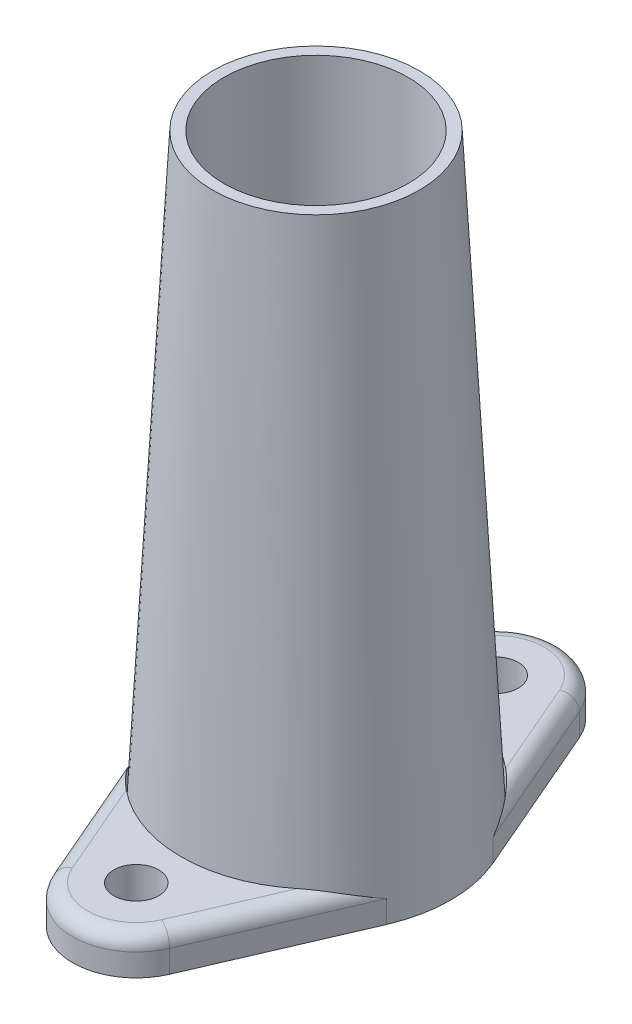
ISO-10303-21;
HEADER;
FILE_DESCRIPTION(('STEP AP214'),'2;1');
FILE_NAME('part.step','',(''),(''),'','','');
FILE_SCHEMA(('AUTOMOTIVE_DESIGN { 1 0 10303 214 1 1 1 1 }'));
ENDSEC;
DATA;
#1=APPLICATION_CONTEXT('core data for automotive mechanical design processes');
#2=APPLICATION_PROTOCOL_DEFINITION('international standard','automotive_design',2000,#1);
#3=PRODUCT_CONTEXT('',#1,'mechanical');
#4=PRODUCT('Part','Part','',(#3));
#5=PRODUCT_RELATED_PRODUCT_CATEGORY('part','',(#4));
#6=PRODUCT_DEFINITION_FORMATION('','',#4);
#7=PRODUCT_DEFINITION_CONTEXT('part definition',#1,'design');
#8=PRODUCT_DEFINITION('design','',#6,#7);
#9=PRODUCT_DEFINITION_SHAPE('','',#8);
#10=(LENGTH_UNIT() NAMED_UNIT(*) SI_UNIT(.MILLI.,.METRE.));
#11=(NAMED_UNIT(*) PLANE_ANGLE_UNIT() SI_UNIT($,.RADIAN.));
#12=(NAMED_UNIT(*) SI_UNIT($,.STERADIAN.) SOLID_ANGLE_UNIT());
#13=UNCERTAINTY_MEASURE_WITH_UNIT(LENGTH_MEASURE(1.E-05),#10,'distance_accuracy_value','');
#14=(GEOMETRIC_REPRESENTATION_CONTEXT(3) GLOBAL_UNCERTAINTY_ASSIGNED_CONTEXT((#13)) GLOBAL_UNIT_ASSIGNED_CONTEXT((#10,
#11,#12)) REPRESENTATION_CONTEXT('',''));
#15=CARTESIAN_POINT('',(0.,0.,0.));
#16=DIRECTION('',(0.,0.,1.));
#17=DIRECTION('',(1.,0.,0.));
#18=AXIS2_PLACEMENT_3D('',#15,#16,#17);
#19=CARTESIAN_POINT('',(0.,2.5,12.));
#20=DIRECTION('',(0.,-1.,0.));
#21=DIRECTION('',(0.,0.,-1.));
#22=AXIS2_PLACEMENT_3D('',#19,#20,#21);
#23=CYLINDRICAL_SURFACE('',#22,4.24912199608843);
#24=DIRECTION('',(0.,-1.,0.));
#25=VECTOR('',#24,1.);
#26=CARTESIAN_POINT('',(3.90192975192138,2.5,13.6822550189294));
#27=LINE('',#26,#25);
#28=CARTESIAN_POINT('',(3.90192975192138,1.5,13.6822550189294));
#29=VERTEX_POINT('',#28);
#30=CARTESIAN_POINT('',(3.90192975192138,0.,13.6822550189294));
#31=VERTEX_POINT('',#30);
#32=EDGE_CURVE('E115',#29,#31,#27,.T.);
#33=ORIENTED_EDGE('',*,*,#32,.F.);
#34=CARTESIAN_POINT('',(0.,1.5,12.));
#35=DIRECTION('',(0.,-1.,0.));
#36=DIRECTION('',(0.,0.,-1.));
#37=AXIS2_PLACEMENT_3D('',#34,#35,#36);
#38=CIRCLE('',#37,4.24912199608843);
#39=CARTESIAN_POINT('',(-3.90192975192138,1.5,13.6822550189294));
#40=VERTEX_POINT('',#39);
#41=EDGE_CURVE('E44',#29,#40,#38,.T.);
#42=ORIENTED_EDGE('',*,*,#41,.T.);
#43=DIRECTION('',(0.,-1.,0.));
#44=VECTOR('',#43,1.);
#45=CARTESIAN_POINT('',(-3.90192975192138,2.5,13.6822550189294));
#46=LINE('',#45,#44);
#47=CARTESIAN_POINT('',(-3.90192975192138,0.,13.6822550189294));
#48=VERTEX_POINT('',#47);
#49=EDGE_CURVE('E85',#40,#48,#46,.T.);
#50=ORIENTED_EDGE('',*,*,#49,.T.);
#51=CARTESIAN_POINT('',(0.,0.,12.));
#52=DIRECTION('',(0.,-1.,0.));
#53=DIRECTION('',(0.,0.,-1.));
#54=AXIS2_PLACEMENT_3D('',#51,#52,#53);
#55=CIRCLE('',#54,4.24912199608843);
#56=EDGE_CURVE('E88',#31,#48,#55,.T.);
#57=ORIENTED_EDGE('',*,*,#56,.F.);
#58=EDGE_LOOP('',(#33,#42,#50,#57));
#59=FACE_BOUND('',#58,.T.);
#60=ADVANCED_FACE('F37',(#59),#23,.T.);
#61=CARTESIAN_POINT('',(8.26461744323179,2.5,3.56315850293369));
#62=DIRECTION('',(0.918290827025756,0.,0.395906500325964));
#63=DIRECTION('',(0.395906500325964,0.,-0.918290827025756));
#64=AXIS2_PLACEMENT_3D('',#61,#62,#63);
#65=PLANE('',#64);
#66=DIRECTION('',(0.,-1.,0.));
#67=VECTOR('',#66,1.);
#68=CARTESIAN_POINT('',(8.26461744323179,2.5,3.56315850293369));
#69=LINE('',#68,#67);
#70=CARTESIAN_POINT('',(8.26461744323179,1.5,3.56315850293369));
#71=VERTEX_POINT('',#70);
#72=CARTESIAN_POINT('',(8.26461744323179,0.,3.56315850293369));
#73=VERTEX_POINT('',#72);
#74=EDGE_CURVE('E118',#71,#73,#69,.T.);
#75=ORIENTED_EDGE('',*,*,#74,.F.);
#76=DIRECTION('',(-0.395906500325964,0.,0.918290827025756));
#77=VECTOR('',#76,1.);
#78=CARTESIAN_POINT('',(3.90192975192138,1.5,13.6822550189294));
#79=LINE('',#78,#77);
#80=EDGE_CURVE('E117',#71,#29,#79,.T.);
#81=ORIENTED_EDGE('',*,*,#80,.T.);
#82=ORIENTED_EDGE('',*,*,#32,.T.);
#83=DIRECTION('',(-0.395906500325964,0.,0.918290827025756));
#84=VECTOR('',#83,1.);
#85=CARTESIAN_POINT('',(8.26461744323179,0.,3.56315850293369));
#86=LINE('',#85,#84);
#87=EDGE_CURVE('E103',#73,#31,#86,.T.);
#88=ORIENTED_EDGE('',*,*,#87,.F.);
#89=EDGE_LOOP('',(#75,#81,#82,#88));
#90=FACE_BOUND('',#89,.T.);
#91=ADVANCED_FACE('F149',(#90),#65,.T.);
#92=CARTESIAN_POINT('',(0.,2.5,0.));
#93=DIRECTION('',(0.,-1.,0.));
#94=DIRECTION('',(0.,0.,-1.));
#95=AXIS2_PLACEMENT_3D('',#92,#93,#94);
#96=CYLINDRICAL_SURFACE('',#95,8.99999999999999);
#97=CARTESIAN_POINT('',(0.,2.5,0.));
#98=DIRECTION('',(0.,1.,0.));
#99=DIRECTION('',(0.,0.,-1.));
#100=AXIS2_PLACEMENT_3D('',#97,#98,#99);
#101=CIRCLE('',#100,8.99999999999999);
#102=CARTESIAN_POINT('',(-5.71396229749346,2.5,6.9534620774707));
#103=VERTEX_POINT('',#102);
#104=CARTESIAN_POINT('',(5.71396229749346,2.5,6.9534620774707));
#105=VERTEX_POINT('',#104);
#106=EDGE_CURVE('E91',#103,#105,#101,.T.);
#107=ORIENTED_EDGE('',*,*,#106,.T.);
#108=CARTESIAN_POINT('',(5.71396229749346,2.5,6.9534620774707));
#109=CARTESIAN_POINT('',(5.77059353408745,2.49998739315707,6.90692800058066));
#110=CARTESIAN_POINT('',(5.82664006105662,2.49830917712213,6.859710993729));
#111=CARTESIAN_POINT('',(5.93744783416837,2.49200640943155,6.76402696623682));
#112=CARTESIAN_POINT('',(5.99220962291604,2.48738312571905,6.71556049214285));
#113=CARTESIAN_POINT('',(6.10027095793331,2.47558644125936,6.61755292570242));
#114=CARTESIAN_POINT('',(6.15357325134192,2.46841824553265,6.56801421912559));
#115=CARTESIAN_POINT('',(6.2587822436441,2.4518351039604,6.46783753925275));
#116=CARTESIAN_POINT('',(6.31068877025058,2.44241988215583,6.41719943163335));
#117=CARTESIAN_POINT('',(6.46380248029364,2.41130627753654,6.26418496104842));
#118=CARTESIAN_POINT('',(6.56289081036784,2.38668172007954,6.16026615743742));
#119=CARTESIAN_POINT('',(6.7552663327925,2.33131666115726,5.94868467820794));
#120=CARTESIAN_POINT('',(6.848549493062,2.3005719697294,5.84101947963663));
#121=CARTESIAN_POINT('',(7.07554752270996,2.21733083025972,5.56620611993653));
#122=CARTESIAN_POINT('',(7.20548547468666,2.16176131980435,5.39684889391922));
#123=CARTESIAN_POINT('',(7.45190989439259,2.04331001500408,5.0511538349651));
#124=CARTESIAN_POINT('',(7.56839283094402,1.98042630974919,4.87481418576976));
#125=CARTESIAN_POINT('',(7.89795450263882,1.78489373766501,4.33585158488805));
#126=CARTESIAN_POINT('',(8.09121686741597,1.64533435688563,3.96319863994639));
#127=CARTESIAN_POINT('',(8.25986110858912,1.50399992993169,3.57417548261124));
#128=CARTESIAN_POINT('',(8.26224205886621,1.5019999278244,3.56866810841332));
#129=CARTESIAN_POINT('',(8.2646174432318,1.5,3.56315850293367));
#130=B_SPLINE_CURVE_WITH_KNOTS('',3,(#108,#109,#110,#111,#112,#113,#114,#115,#116,#117,#118,
#119,#120,#121,#122,#123,#124,#125,#126,#127,#128,#129),.UNSPECIFIED.,.F.,.F.,(4,2,2,2,2,2,2,2,
2,2,4),(0.,0.219841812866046,0.439589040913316,0.658889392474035,0.87821669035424,
1.31489484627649,1.751872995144,2.41277681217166,3.0738536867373,4.39566422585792,
4.41463790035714),.UNSPECIFIED.);
#131=EDGE_CURVE('E136',#105,#71,#130,.T.);
#132=ORIENTED_EDGE('',*,*,#131,.T.);
#133=ORIENTED_EDGE('',*,*,#74,.T.);
#134=CARTESIAN_POINT('',(0.,0.,0.));
#135=DIRECTION('',(0.,1.,0.));
#136=DIRECTION('',(0.,0.,-1.));
#137=AXIS2_PLACEMENT_3D('',#134,#135,#136);
#138=CIRCLE('',#137,8.99999999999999);
#139=CARTESIAN_POINT('',(-8.26461744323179,0.,3.5631585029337));
#140=VERTEX_POINT('',#139);
#141=EDGE_CURVE('E99',#140,#73,#138,.T.);
#142=ORIENTED_EDGE('',*,*,#141,.F.);
#143=DIRECTION('',(0.,-1.,0.));
#144=VECTOR('',#143,1.);
#145=CARTESIAN_POINT('',(-8.26461744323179,2.5,3.5631585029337));
#146=LINE('',#145,#144);
#147=CARTESIAN_POINT('',(-8.26461744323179,1.5,3.5631585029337));
#148=VERTEX_POINT('',#147);
#149=EDGE_CURVE('E90',#148,#140,#146,.T.);
#150=ORIENTED_EDGE('',*,*,#149,.F.);
#151=CARTESIAN_POINT('',(-5.71396229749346,2.5,6.9534620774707));
#152=CARTESIAN_POINT('',(-5.77059353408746,2.49998739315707,6.90692800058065));
#153=CARTESIAN_POINT('',(-5.82664006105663,2.49830917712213,6.85971099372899));
#154=CARTESIAN_POINT('',(-5.93744783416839,2.49200640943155,6.7640269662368));
#155=CARTESIAN_POINT('',(-5.99220962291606,2.48738312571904,6.71556049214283));
#156=CARTESIAN_POINT('',(-6.10027095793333,2.47558644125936,6.61755292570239));
#157=CARTESIAN_POINT('',(-6.15357325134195,2.46841824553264,6.56801421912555));
#158=CARTESIAN_POINT('',(-6.25878224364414,2.45183510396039,6.46783753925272));
#159=CARTESIAN_POINT('',(-6.31068877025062,2.44241988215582,6.41719943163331));
#160=CARTESIAN_POINT('',(-6.46380248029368,2.41130627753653,6.26418496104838));
#161=CARTESIAN_POINT('',(-6.56289081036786,2.38668172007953,6.1602661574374));
#162=CARTESIAN_POINT('',(-6.75526633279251,2.33131666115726,5.94868467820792));
#163=CARTESIAN_POINT('',(-6.848549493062,2.3005719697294,5.84101947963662));
#164=CARTESIAN_POINT('',(-7.07554752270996,2.21733083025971,5.56620611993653));
#165=CARTESIAN_POINT('',(-7.20548547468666,2.16176131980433,5.39684889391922));
#166=CARTESIAN_POINT('',(-7.45190989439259,2.0433100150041,5.0511538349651));
#167=CARTESIAN_POINT('',(-7.56839283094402,1.98042630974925,4.87481418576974));
#168=CARTESIAN_POINT('',(-7.8979545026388,1.78489373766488,4.33585158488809));
#169=CARTESIAN_POINT('',(-8.09121686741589,1.64533435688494,3.96319863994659));
#170=CARTESIAN_POINT('',(-8.25986110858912,1.50399992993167,3.57417548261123));
#171=CARTESIAN_POINT('',(-8.26224205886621,1.50199992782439,3.56866810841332));
#172=CARTESIAN_POINT('',(-8.2646174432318,1.5,3.56315850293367));
#173=B_SPLINE_CURVE_WITH_KNOTS('',3,(#151,#152,#153,#154,#155,#156,#157,#158,#159,#160,#161,
#162,#163,#164,#165,#166,#167,#168,#169,#170,#171,#172),.UNSPECIFIED.,.F.,.F.,(4,2,2,2,2,2,2,2,
2,2,4),(0.,0.219841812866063,0.439589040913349,0.658889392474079,0.878216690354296,
1.31489484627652,1.751872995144,2.41277681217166,3.0738536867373,4.39566422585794,
4.41463790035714),.UNSPECIFIED.);
#174=EDGE_CURVE('E129',#148,#103,#173,.F.);
#175=ORIENTED_EDGE('',*,*,#174,.T.);
#176=EDGE_LOOP('',(#107,#132,#133,#142,#150,#175));
#177=FACE_BOUND('',#176,.T.);
#178=ADVANCED_FACE('F145',(#177),#96,.F.);
#179=CARTESIAN_POINT('',(-8.26461744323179,2.5,3.56315850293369));
#180=DIRECTION('',(-0.918290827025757,0.,0.395906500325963));
#181=DIRECTION('',(0.395906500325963,0.,0.918290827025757));
#182=AXIS2_PLACEMENT_3D('',#179,#180,#181);
#183=PLANE('',#182);
#184=ORIENTED_EDGE('',*,*,#49,.F.);
#185=DIRECTION('',(-0.395906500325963,0.,-0.918290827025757));
#186=VECTOR('',#185,1.);
#187=CARTESIAN_POINT('',(-8.26461744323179,1.5,3.5631585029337));
#188=LINE('',#187,#186);
#189=EDGE_CURVE('E12',#40,#148,#188,.T.);
#190=ORIENTED_EDGE('',*,*,#189,.T.);
#191=ORIENTED_EDGE('',*,*,#149,.T.);
#192=DIRECTION('',(-0.395906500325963,0.,-0.918290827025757));
#193=VECTOR('',#192,1.);
#194=CARTESIAN_POINT('',(-8.26461744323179,0.,3.56315850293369));
#195=LINE('',#194,#193);
#196=EDGE_CURVE('E94',#48,#140,#195,.T.);
#197=ORIENTED_EDGE('',*,*,#196,.F.);
#198=EDGE_LOOP('',(#184,#190,#191,#197));
#199=FACE_BOUND('',#198,.T.);
#200=ADVANCED_FACE('F95',(#199),#183,.T.);
#201=CARTESIAN_POINT('',(0.,2.5,12.));
#202=DIRECTION('',(0.,-1.,0.));
#203=DIRECTION('',(0.,0.,-1.));
#204=AXIS2_PLACEMENT_3D('',#201,#202,#203);
#205=PLANE('',#204);
#206=CARTESIAN_POINT('',(0.,2.5,12.));
#207=DIRECTION('',(0.,-1.,0.));
#208=DIRECTION('',(0.,0.,1.));
#209=AXIS2_PLACEMENT_3D('',#206,#207,#208);
#210=CIRCLE('',#209,1.5);
#211=CARTESIAN_POINT('',(0.,2.5,13.5));
#212=VERTEX_POINT('',#211);
#213=EDGE_CURVE('E104',#212,#212,#210,.T.);
#214=ORIENTED_EDGE('',*,*,#213,.T.);
#215=EDGE_LOOP('',(#214));
#216=FACE_BOUND('',#215,.T.);
#217=CARTESIAN_POINT('',(0.,2.5,12.));
#218=DIRECTION('',(0.,-1.,0.));
#219=DIRECTION('',(0.,0.,-1.));
#220=AXIS2_PLACEMENT_3D('',#217,#218,#219);
#221=CIRCLE('',#220,3.24912199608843);
#222=CARTESIAN_POINT('',(-2.98363892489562,2.5,13.2863485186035));
#223=VERTEX_POINT('',#222);
#224=CARTESIAN_POINT('',(2.98363892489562,2.5,13.2863485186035));
#225=VERTEX_POINT('',#224);
#226=EDGE_CURVE('E125',#223,#225,#221,.F.);
#227=ORIENTED_EDGE('',*,*,#226,.T.);
#228=DIRECTION('',(-0.395906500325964,0.,0.918290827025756));
#229=VECTOR('',#228,1.);
#230=CARTESIAN_POINT('',(7.34632661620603,2.5,3.16725200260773));
#231=LINE('',#230,#229);
#232=EDGE_CURVE('E127',#225,#105,#231,.F.);
#233=ORIENTED_EDGE('',*,*,#232,.T.);
#234=ORIENTED_EDGE('',*,*,#106,.F.);
#235=DIRECTION('',(-0.395906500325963,0.,-0.918290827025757));
#236=VECTOR('',#235,1.);
#237=CARTESIAN_POINT('',(-2.98363892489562,2.5,13.2863485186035));
#238=LINE('',#237,#236);
#239=EDGE_CURVE('E123',#103,#223,#238,.F.);
#240=ORIENTED_EDGE('',*,*,#239,.T.);
#241=EDGE_LOOP('',(#227,#233,#234,#240));
#242=FACE_BOUND('',#241,.T.);
#243=ADVANCED_FACE('F154',(#216,#242),#205,.F.);
#244=CARTESIAN_POINT('',(0.,0.,12.));
#245=DIRECTION('',(0.,-1.,0.));
#246=DIRECTION('',(0.,0.,-1.));
#247=AXIS2_PLACEMENT_3D('',#244,#245,#246);
#248=PLANE('',#247);
#249=CARTESIAN_POINT('',(0.,0.,12.));
#250=DIRECTION('',(0.,-1.,0.));
#251=DIRECTION('',(0.,0.,1.));
#252=AXIS2_PLACEMENT_3D('',#249,#250,#251);
#253=CIRCLE('',#252,1.5);
#254=CARTESIAN_POINT('',(0.,0.,13.5));
#255=VERTEX_POINT('',#254);
#256=EDGE_CURVE('E107',#255,#255,#253,.T.);
#257=ORIENTED_EDGE('',*,*,#256,.F.);
#258=EDGE_LOOP('',(#257));
#259=FACE_BOUND('',#258,.T.);
#260=ORIENTED_EDGE('',*,*,#56,.T.);
#261=ORIENTED_EDGE('',*,*,#196,.T.);
#262=ORIENTED_EDGE('',*,*,#141,.T.);
#263=ORIENTED_EDGE('',*,*,#87,.T.);
#264=EDGE_LOOP('',(#260,#261,#262,#263));
#265=FACE_BOUND('',#264,.T.);
#266=ADVANCED_FACE('F101',(#259,#265),#248,.T.);
#267=CARTESIAN_POINT('',(0.,2.5,12.));
#268=DIRECTION('',(0.,-1.,0.));
#269=DIRECTION('',(0.,0.,-1.));
#270=AXIS2_PLACEMENT_3D('',#267,#268,#269);
#271=CYLINDRICAL_SURFACE('',#270,1.5);
#272=ORIENTED_EDGE('',*,*,#213,.F.);
#273=EDGE_LOOP('',(#272));
#274=FACE_BOUND('',#273,.T.);
#275=ORIENTED_EDGE('',*,*,#256,.T.);
#276=EDGE_LOOP('',(#275));
#277=FACE_BOUND('',#276,.T.);
#278=ADVANCED_FACE('F191',(#274,#277),#271,.F.);
#279=CARTESIAN_POINT('',(-7.34632661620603,1.5,3.16725200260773));
#280=DIRECTION('',(0.395906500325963,0.,0.918290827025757));
#281=DIRECTION('',(0.918290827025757,0.,-0.395906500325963));
#282=AXIS2_PLACEMENT_3D('',#279,#280,#281);
#283=CYLINDRICAL_SURFACE('',#282,1.);
#284=ORIENTED_EDGE('',*,*,#174,.F.);
#285=ORIENTED_EDGE('',*,*,#189,.F.);
#286=CARTESIAN_POINT('',(-2.98363892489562,1.5,13.2863485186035));
#287=DIRECTION('',(0.395906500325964,0.,0.918290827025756));
#288=DIRECTION('',(0.918290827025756,0.,-0.395906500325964));
#289=AXIS2_PLACEMENT_3D('',#286,#287,#288);
#290=CIRCLE('',#289,1.);
#291=EDGE_CURVE('E177',#223,#40,#290,.T.);
#292=ORIENTED_EDGE('',*,*,#291,.F.);
#293=ORIENTED_EDGE('',*,*,#239,.F.);
#294=EDGE_LOOP('',(#284,#285,#292,#293));
#295=FACE_BOUND('',#294,.T.);
#296=ADVANCED_FACE('F141',(#295),#283,.T.);
#297=CARTESIAN_POINT('',(0.,1.5,12.));
#298=DIRECTION('',(0.,-1.,0.));
#299=DIRECTION('',(0.,0.,-1.));
#300=AXIS2_PLACEMENT_3D('',#297,#298,#299);
#301=TOROIDAL_SURFACE('',#300,3.24912199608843,1.);
#302=ORIENTED_EDGE('',*,*,#291,.T.);
#303=ORIENTED_EDGE('',*,*,#41,.F.);
#304=CARTESIAN_POINT('',(2.98363892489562,1.5,13.2863485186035));
#305=DIRECTION('',(0.395906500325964,0.,-0.918290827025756));
#306=DIRECTION('',(-0.918290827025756,0.,-0.395906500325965));
#307=AXIS2_PLACEMENT_3D('',#304,#305,#306);
#308=CIRCLE('',#307,1.);
#309=EDGE_CURVE('E174',#225,#29,#308,.T.);
#310=ORIENTED_EDGE('',*,*,#309,.F.);
#311=ORIENTED_EDGE('',*,*,#226,.F.);
#312=EDGE_LOOP('',(#302,#303,#310,#311));
#313=FACE_BOUND('',#312,.T.);
#314=ADVANCED_FACE('F180',(#313),#301,.T.);
#315=CARTESIAN_POINT('',(7.34632661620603,1.5,3.16725200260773));
#316=DIRECTION('',(0.395906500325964,0.,-0.918290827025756));
#317=DIRECTION('',(-0.918290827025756,0.,-0.395906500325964));
#318=AXIS2_PLACEMENT_3D('',#315,#316,#317);
#319=CYLINDRICAL_SURFACE('',#318,1.);
#320=ORIENTED_EDGE('',*,*,#131,.F.);
#321=ORIENTED_EDGE('',*,*,#232,.F.);
#322=ORIENTED_EDGE('',*,*,#309,.T.);
#323=ORIENTED_EDGE('',*,*,#80,.F.);
#324=EDGE_LOOP('',(#320,#321,#322,#323));
#325=FACE_BOUND('',#324,.T.);
#326=ADVANCED_FACE('F171',(#325),#319,.T.);
#327=CLOSED_SHELL('',(#60,#91,#178,#200,#243,#266,#278,#296,#314,#326));
#328=MANIFOLD_SOLID_BREP('B2',#327);
#329=CARTESIAN_POINT('',(0.,2.5,0.));
#330=DIRECTION('',(0.,-1.,0.));
#331=DIRECTION('',(0.,0.,-1.));
#332=AXIS2_PLACEMENT_3D('',#329,#330,#331);
#333=CYLINDRICAL_SURFACE('',#332,8.99999999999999);
#334=DIRECTION('',(0.,-1.,0.));
#335=VECTOR('',#334,1.);
#336=CARTESIAN_POINT('',(8.26461744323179,2.5,-3.56315850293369));
#337=LINE('',#336,#335);
#338=CARTESIAN_POINT('',(8.26461744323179,1.5,-3.56315850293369));
#339=VERTEX_POINT('',#338);
#340=CARTESIAN_POINT('',(8.26461744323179,0.,-3.56315850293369));
#341=VERTEX_POINT('',#340);
#342=EDGE_CURVE('E329',#339,#341,#337,.T.);
#343=ORIENTED_EDGE('',*,*,#342,.F.);
#344=CARTESIAN_POINT('',(5.71396229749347,2.5,-6.95346207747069));
#345=CARTESIAN_POINT('',(5.77059353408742,2.49998739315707,-6.90692800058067));
#346=CARTESIAN_POINT('',(5.82664006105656,2.49830917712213,-6.85971099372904));
#347=CARTESIAN_POINT('',(5.93744783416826,2.49200640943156,-6.76402696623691));
#348=CARTESIAN_POINT('',(5.99220962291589,2.48738312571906,-6.71556049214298));
#349=CARTESIAN_POINT('',(6.10027095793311,2.47558644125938,-6.61755292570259));
#350=CARTESIAN_POINT('',(6.1535732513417,2.46841824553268,-6.56801421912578));
#351=CARTESIAN_POINT('',(6.25878224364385,2.45183510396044,-6.467837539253));
#352=CARTESIAN_POINT('',(6.3106887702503,2.44241988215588,-6.41719943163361));
#353=CARTESIAN_POINT('',(6.4638024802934,2.41130627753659,-6.26418496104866));
#354=CARTESIAN_POINT('',(6.56289081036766,2.38668172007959,-6.16026615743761));
#355=CARTESIAN_POINT('',(6.75526633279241,2.33131666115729,-5.94868467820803));
#356=CARTESIAN_POINT('',(6.84854949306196,2.30057196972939,-5.84101947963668));
#357=CARTESIAN_POINT('',(7.07554752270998,2.21733083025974,-5.56620611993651));
#358=CARTESIAN_POINT('',(7.20548547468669,2.16176131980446,-5.39684889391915));
#359=CARTESIAN_POINT('',(7.45190989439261,2.04331001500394,-5.05115383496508));
#360=CARTESIAN_POINT('',(7.56839283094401,1.9804263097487,-4.87481418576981));
#361=CARTESIAN_POINT('',(7.89795450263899,1.78489373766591,-4.33585158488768));
#362=CARTESIAN_POINT('',(8.09121686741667,1.6453343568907,-3.96319863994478));
#363=CARTESIAN_POINT('',(8.25986110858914,1.50399992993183,-3.57417548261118));
#364=CARTESIAN_POINT('',(8.26224205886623,1.50199992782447,-3.56866810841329));
#365=CARTESIAN_POINT('',(8.2646174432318,1.5,-3.56315850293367));
#366=B_SPLINE_CURVE_WITH_KNOTS('',3,(#344,#345,#346,#347,#348,#349,#350,#351,#352,#353,#354,
#355,#356,#357,#358,#359,#360,#361,#362,#363,#364,#365),.UNSPECIFIED.,.F.,.F.,(4,2,2,2,2,2,2,2,
2,2,4),(0.,0.219841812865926,0.439589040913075,0.6588893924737,0.87821669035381,
1.31489484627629,1.751872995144,2.4127768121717,3.07385368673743,4.39566422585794,
4.41463790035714),.UNSPECIFIED.);
#367=CARTESIAN_POINT('',(5.71396229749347,2.5,-6.95346207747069));
#368=VERTEX_POINT('',#367);
#369=EDGE_CURVE('E342',#339,#368,#366,.F.);
#370=ORIENTED_EDGE('',*,*,#369,.T.);
#371=CARTESIAN_POINT('',(0.,2.5,0.));
#372=DIRECTION('',(0.,1.,0.));
#373=DIRECTION('',(0.,0.,1.));
#374=AXIS2_PLACEMENT_3D('',#371,#372,#373);
#375=CIRCLE('',#374,8.99999999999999);
#376=CARTESIAN_POINT('',(-5.71396229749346,2.5,-6.95346207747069));
#377=VERTEX_POINT('',#376);
#378=EDGE_CURVE('E306',#368,#377,#375,.T.);
#379=ORIENTED_EDGE('',*,*,#378,.T.);
#380=CARTESIAN_POINT('',(-5.71396229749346,2.5,-6.95346207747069));
#381=CARTESIAN_POINT('',(-5.77059353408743,2.49998739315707,-6.90692800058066));
#382=CARTESIAN_POINT('',(-5.82664006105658,2.49830917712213,-6.85971099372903));
#383=CARTESIAN_POINT('',(-5.93744783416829,2.49200640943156,-6.76402696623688));
#384=CARTESIAN_POINT('',(-5.99220962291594,2.48738312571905,-6.71556049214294));
#385=CARTESIAN_POINT('',(-6.10027095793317,2.47558644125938,-6.61755292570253));
#386=CARTESIAN_POINT('',(-6.15357325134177,2.46841824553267,-6.56801421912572));
#387=CARTESIAN_POINT('',(-6.25878224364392,2.45183510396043,-6.46783753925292));
#388=CARTESIAN_POINT('',(-6.31068877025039,2.44241988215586,-6.41719943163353));
#389=CARTESIAN_POINT('',(-6.46380248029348,2.41130627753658,-6.26418496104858));
#390=CARTESIAN_POINT('',(-6.56289081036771,2.38668172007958,-6.16026615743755));
#391=CARTESIAN_POINT('',(-6.75526633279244,2.33131666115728,-5.948684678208));
#392=CARTESIAN_POINT('',(-6.84854949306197,2.30057196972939,-5.84101947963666));
#393=CARTESIAN_POINT('',(-7.07554752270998,2.21733083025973,-5.56620611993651));
#394=CARTESIAN_POINT('',(-7.20548547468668,2.16176131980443,-5.39684889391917));
#395=CARTESIAN_POINT('',(-7.45190989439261,2.04331001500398,-5.05115383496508));
#396=CARTESIAN_POINT('',(-7.56839283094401,1.98042630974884,-4.87481418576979));
#397=CARTESIAN_POINT('',(-7.89795450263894,1.78489373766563,-4.33585158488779));
#398=CARTESIAN_POINT('',(-8.09121686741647,1.64533435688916,-3.96319863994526));
#399=CARTESIAN_POINT('',(-8.25986110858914,1.50399992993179,-3.5741754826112));
#400=CARTESIAN_POINT('',(-8.26224205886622,1.50199992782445,-3.5686681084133));
#401=CARTESIAN_POINT('',(-8.2646174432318,1.5,-3.56315850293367));
#402=B_SPLINE_CURVE_WITH_KNOTS('',3,(#380,#381,#382,#383,#384,#385,#386,#387,#388,#389,#390,
#391,#392,#393,#394,#395,#396,#397,#398,#399,#400,#401),.UNSPECIFIED.,.F.,.F.,(4,2,2,2,2,2,2,2,
2,2,4),(0.,0.219841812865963,0.439589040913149,0.658889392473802,0.878216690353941,
1.31489484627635,1.751872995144,2.41277681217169,3.0738536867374,4.39566422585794,
4.41463790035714),.UNSPECIFIED.);
#403=CARTESIAN_POINT('',(-8.26461744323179,1.5,-3.56315850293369));
#404=VERTEX_POINT('',#403);
#405=EDGE_CURVE('E304',#377,#404,#402,.T.);
#406=ORIENTED_EDGE('',*,*,#405,.T.);
#407=DIRECTION('',(0.,-1.,0.));
#408=VECTOR('',#407,1.);
#409=CARTESIAN_POINT('',(-8.26461744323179,2.5,-3.56315850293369));
#410=LINE('',#409,#408);
#411=CARTESIAN_POINT('',(-8.26461744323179,0.,-3.56315850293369));
#412=VERTEX_POINT('',#411);
#413=EDGE_CURVE('E296',#404,#412,#410,.T.);
#414=ORIENTED_EDGE('',*,*,#413,.T.);
#415=CARTESIAN_POINT('',(0.,0.,0.));
#416=DIRECTION('',(0.,1.,0.));
#417=DIRECTION('',(0.,0.,1.));
#418=AXIS2_PLACEMENT_3D('',#415,#416,#417);
#419=CIRCLE('',#418,8.99999999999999);
#420=EDGE_CURVE('E300',#341,#412,#419,.T.);
#421=ORIENTED_EDGE('',*,*,#420,.F.);
#422=EDGE_LOOP('',(#343,#370,#379,#406,#414,#421));
#423=FACE_BOUND('',#422,.T.);
#424=ADVANCED_FACE('F244',(#423),#333,.F.);
#425=CARTESIAN_POINT('',(8.26461744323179,2.5,-3.56315850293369));
#426=DIRECTION('',(0.918290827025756,0.,-0.395906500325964));
#427=DIRECTION('',(-0.395906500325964,0.,-0.918290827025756));
#428=AXIS2_PLACEMENT_3D('',#425,#426,#427);
#429=PLANE('',#428);
#430=DIRECTION('',(0.,-1.,0.));
#431=VECTOR('',#430,1.);
#432=CARTESIAN_POINT('',(3.90192975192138,2.5,-13.6822550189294));
#433=LINE('',#432,#431);
#434=CARTESIAN_POINT('',(3.90192975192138,1.5,-13.6822550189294));
#435=VERTEX_POINT('',#434);
#436=CARTESIAN_POINT('',(3.90192975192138,0.,-13.6822550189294));
#437=VERTEX_POINT('',#436);
#438=EDGE_CURVE('E332',#435,#437,#433,.T.);
#439=ORIENTED_EDGE('',*,*,#438,.F.);
#440=DIRECTION('',(0.395906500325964,0.,0.918290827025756));
#441=VECTOR('',#440,1.);
#442=CARTESIAN_POINT('',(8.26461744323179,1.5,-3.56315850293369));
#443=LINE('',#442,#441);
#444=EDGE_CURVE('E331',#435,#339,#443,.T.);
#445=ORIENTED_EDGE('',*,*,#444,.T.);
#446=ORIENTED_EDGE('',*,*,#342,.T.);
#447=DIRECTION('',(0.395906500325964,0.,0.918290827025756));
#448=VECTOR('',#447,1.);
#449=CARTESIAN_POINT('',(8.26461744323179,0.,-3.56315850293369));
#450=LINE('',#449,#448);
#451=EDGE_CURVE('E318',#437,#341,#450,.T.);
#452=ORIENTED_EDGE('',*,*,#451,.F.);
#453=EDGE_LOOP('',(#439,#445,#446,#452));
#454=FACE_BOUND('',#453,.T.);
#455=ADVANCED_FACE('F366',(#454),#429,.T.);
#456=CARTESIAN_POINT('',(0.,2.5,-12.));
#457=DIRECTION('',(0.,-1.,0.));
#458=DIRECTION('',(0.,0.,-1.));
#459=AXIS2_PLACEMENT_3D('',#456,#457,#458);
#460=CYLINDRICAL_SURFACE('',#459,4.24912199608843);
#461=DIRECTION('',(0.,-1.,0.));
#462=VECTOR('',#461,1.);
#463=CARTESIAN_POINT('',(-3.90192975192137,2.5,-13.6822550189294));
#464=LINE('',#463,#462);
#465=CARTESIAN_POINT('',(-3.90192975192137,1.5,-13.6822550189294));
#466=VERTEX_POINT('',#465);
#467=CARTESIAN_POINT('',(-3.90192975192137,0.,-13.6822550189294));
#468=VERTEX_POINT('',#467);
#469=EDGE_CURVE('E305',#466,#468,#464,.T.);
#470=ORIENTED_EDGE('',*,*,#469,.F.);
#471=CARTESIAN_POINT('',(0.,1.5,-12.));
#472=DIRECTION('',(0.,1.,0.));
#473=DIRECTION('',(0.,0.,1.));
#474=AXIS2_PLACEMENT_3D('',#471,#472,#473);
#475=CIRCLE('',#474,4.24912199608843);
#476=EDGE_CURVE('E252',#466,#435,#475,.F.);
#477=ORIENTED_EDGE('',*,*,#476,.T.);
#478=ORIENTED_EDGE('',*,*,#438,.T.);
#479=CARTESIAN_POINT('',(0.,0.,-12.));
#480=DIRECTION('',(0.,-1.,0.));
#481=DIRECTION('',(0.,0.,1.));
#482=AXIS2_PLACEMENT_3D('',#479,#480,#481);
#483=CIRCLE('',#482,4.24912199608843);
#484=EDGE_CURVE('E314',#468,#437,#483,.T.);
#485=ORIENTED_EDGE('',*,*,#484,.F.);
#486=EDGE_LOOP('',(#470,#477,#478,#485));
#487=FACE_BOUND('',#486,.T.);
#488=ADVANCED_FACE('F369',(#487),#460,.T.);
#489=CARTESIAN_POINT('',(-8.26461744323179,2.5,-3.56315850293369));
#490=DIRECTION('',(-0.918290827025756,0.,-0.395906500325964));
#491=DIRECTION('',(-0.395906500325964,0.,0.918290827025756));
#492=AXIS2_PLACEMENT_3D('',#489,#490,#491);
#493=PLANE('',#492);
#494=ORIENTED_EDGE('',*,*,#413,.F.);
#495=DIRECTION('',(0.395906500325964,0.,-0.918290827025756));
#496=VECTOR('',#495,1.);
#497=CARTESIAN_POINT('',(-8.26461744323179,1.5,-3.56315850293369));
#498=LINE('',#497,#496);
#499=EDGE_CURVE('E35',#404,#466,#498,.T.);
#500=ORIENTED_EDGE('',*,*,#499,.T.);
#501=ORIENTED_EDGE('',*,*,#469,.T.);
#502=DIRECTION('',(0.395906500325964,0.,-0.918290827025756));
#503=VECTOR('',#502,1.);
#504=CARTESIAN_POINT('',(-8.26461744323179,0.,-3.56315850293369));
#505=LINE('',#504,#503);
#506=EDGE_CURVE('E309',#412,#468,#505,.T.);
#507=ORIENTED_EDGE('',*,*,#506,.F.);
#508=EDGE_LOOP('',(#494,#500,#501,#507));
#509=FACE_BOUND('',#508,.T.);
#510=ADVANCED_FACE('F310',(#509),#493,.T.);
#511=CARTESIAN_POINT('',(0.,2.5,0.));
#512=DIRECTION('',(0.,1.,0.));
#513=DIRECTION('',(0.,0.,1.));
#514=AXIS2_PLACEMENT_3D('',#511,#512,#513);
#515=PLANE('',#514);
#516=CARTESIAN_POINT('',(0.,2.5,-12.));
#517=DIRECTION('',(0.,-1.,0.));
#518=DIRECTION('',(0.,0.,-1.));
#519=AXIS2_PLACEMENT_3D('',#516,#517,#518);
#520=CIRCLE('',#519,1.5);
#521=CARTESIAN_POINT('',(0.,2.5,-13.5));
#522=VERTEX_POINT('',#521);
#523=EDGE_CURVE('E319',#522,#522,#520,.T.);
#524=ORIENTED_EDGE('',*,*,#523,.T.);
#525=EDGE_LOOP('',(#524));
#526=FACE_BOUND('',#525,.T.);
#527=ORIENTED_EDGE('',*,*,#378,.F.);
#528=DIRECTION('',(0.395906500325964,0.,0.918290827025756));
#529=VECTOR('',#528,1.);
#530=CARTESIAN_POINT('',(7.34632661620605,2.5,-3.1672520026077));
#531=LINE('',#530,#529);
#532=CARTESIAN_POINT('',(2.98363892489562,2.5,-13.2863485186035));
#533=VERTEX_POINT('',#532);
#534=EDGE_CURVE('E265',#368,#533,#531,.F.);
#535=ORIENTED_EDGE('',*,*,#534,.T.);
#536=CARTESIAN_POINT('',(0.,2.5,-12.));
#537=DIRECTION('',(0.,1.,0.));
#538=DIRECTION('',(0.,0.,1.));
#539=AXIS2_PLACEMENT_3D('',#536,#537,#538);
#540=CIRCLE('',#539,3.24912199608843);
#541=CARTESIAN_POINT('',(-2.98363892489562,2.5,-13.2863485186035));
#542=VERTEX_POINT('',#541);
#543=EDGE_CURVE('E434',#533,#542,#540,.T.);
#544=ORIENTED_EDGE('',*,*,#543,.T.);
#545=DIRECTION('',(0.395906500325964,0.,-0.918290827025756));
#546=VECTOR('',#545,1.);
#547=CARTESIAN_POINT('',(-7.34632661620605,2.5,-3.1672520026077));
#548=LINE('',#547,#546);
#549=EDGE_CURVE('E436',#542,#377,#548,.F.);
#550=ORIENTED_EDGE('',*,*,#549,.T.);
#551=EDGE_LOOP('',(#527,#535,#544,#550));
#552=FACE_BOUND('',#551,.T.);
#553=ADVANCED_FACE('F361',(#526,#552),#515,.T.);
#554=CARTESIAN_POINT('',(0.,0.,0.));
#555=DIRECTION('',(0.,1.,0.));
#556=DIRECTION('',(0.,0.,1.));
#557=AXIS2_PLACEMENT_3D('',#554,#555,#556);
#558=PLANE('',#557);
#559=CARTESIAN_POINT('',(0.,0.,-12.));
#560=DIRECTION('',(0.,-1.,0.));
#561=DIRECTION('',(0.,0.,-1.));
#562=AXIS2_PLACEMENT_3D('',#559,#560,#561);
#563=CIRCLE('',#562,1.5);
#564=CARTESIAN_POINT('',(0.,0.,-13.5));
#565=VERTEX_POINT('',#564);
#566=EDGE_CURVE('E322',#565,#565,#563,.T.);
#567=ORIENTED_EDGE('',*,*,#566,.F.);
#568=EDGE_LOOP('',(#567));
#569=FACE_BOUND('',#568,.T.);
#570=ORIENTED_EDGE('',*,*,#420,.T.);
#571=ORIENTED_EDGE('',*,*,#506,.T.);
#572=ORIENTED_EDGE('',*,*,#484,.T.);
#573=ORIENTED_EDGE('',*,*,#451,.T.);
#574=EDGE_LOOP('',(#570,#571,#572,#573));
#575=FACE_BOUND('',#574,.T.);
#576=ADVANCED_FACE('F316',(#569,#575),#558,.F.);
#577=CARTESIAN_POINT('',(0.,2.5,-12.));
#578=DIRECTION('',(0.,-1.,0.));
#579=DIRECTION('',(0.,0.,-1.));
#580=AXIS2_PLACEMENT_3D('',#577,#578,#579);
#581=CYLINDRICAL_SURFACE('',#580,1.5);
#582=ORIENTED_EDGE('',*,*,#523,.F.);
#583=EDGE_LOOP('',(#582));
#584=FACE_BOUND('',#583,.T.);
#585=ORIENTED_EDGE('',*,*,#566,.T.);
#586=EDGE_LOOP('',(#585));
#587=FACE_BOUND('',#586,.T.);
#588=ADVANCED_FACE('F354',(#584,#587),#581,.F.);
#589=CARTESIAN_POINT('',(-7.34632661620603,1.5,-3.16725200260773));
#590=DIRECTION('',(0.395906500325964,0.,-0.918290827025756));
#591=DIRECTION('',(-0.918290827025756,0.,-0.395906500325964));
#592=AXIS2_PLACEMENT_3D('',#589,#590,#591);
#593=CYLINDRICAL_SURFACE('',#592,1.);
#594=ORIENTED_EDGE('',*,*,#405,.F.);
#595=ORIENTED_EDGE('',*,*,#549,.F.);
#596=CARTESIAN_POINT('',(-2.98363892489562,1.5,-13.2863485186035));
#597=DIRECTION('',(0.395906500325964,0.,-0.918290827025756));
#598=DIRECTION('',(-0.918290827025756,0.,-0.395906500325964));
#599=AXIS2_PLACEMENT_3D('',#596,#597,#598);
#600=CIRCLE('',#599,1.);
#601=EDGE_CURVE('E426',#466,#542,#600,.T.);
#602=ORIENTED_EDGE('',*,*,#601,.F.);
#603=ORIENTED_EDGE('',*,*,#499,.F.);
#604=EDGE_LOOP('',(#594,#595,#602,#603));
#605=FACE_BOUND('',#604,.T.);
#606=ADVANCED_FACE('F348',(#605),#593,.T.);
#607=CARTESIAN_POINT('',(0.,1.5,-12.));
#608=DIRECTION('',(0.,1.,0.));
#609=DIRECTION('',(0.,0.,1.));
#610=AXIS2_PLACEMENT_3D('',#607,#608,#609);
#611=TOROIDAL_SURFACE('',#610,3.24912199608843,1.);
#612=ORIENTED_EDGE('',*,*,#601,.T.);
#613=ORIENTED_EDGE('',*,*,#543,.F.);
#614=CARTESIAN_POINT('',(2.98363892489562,1.5,-13.2863485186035));
#615=DIRECTION('',(0.395906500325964,0.,0.918290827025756));
#616=DIRECTION('',(0.918290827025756,0.,-0.395906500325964));
#617=AXIS2_PLACEMENT_3D('',#614,#615,#616);
#618=CIRCLE('',#617,1.);
#619=EDGE_CURVE('E424',#435,#533,#618,.T.);
#620=ORIENTED_EDGE('',*,*,#619,.F.);
#621=ORIENTED_EDGE('',*,*,#476,.F.);
#622=EDGE_LOOP('',(#612,#613,#620,#621));
#623=FACE_BOUND('',#622,.T.);
#624=ADVANCED_FACE('F353',(#623),#611,.T.);
#625=CARTESIAN_POINT('',(7.34632661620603,1.5,-3.16725200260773));
#626=DIRECTION('',(0.395906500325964,0.,0.918290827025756));
#627=DIRECTION('',(0.918290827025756,0.,-0.395906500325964));
#628=AXIS2_PLACEMENT_3D('',#625,#626,#627);
#629=CYLINDRICAL_SURFACE('',#628,1.);
#630=ORIENTED_EDGE('',*,*,#619,.T.);
#631=ORIENTED_EDGE('',*,*,#534,.F.);
#632=ORIENTED_EDGE('',*,*,#369,.F.);
#633=ORIENTED_EDGE('',*,*,#444,.F.);
#634=EDGE_LOOP('',(#630,#631,#632,#633));
#635=FACE_BOUND('',#634,.T.);
#636=ADVANCED_FACE('F412',(#635),#629,.T.);
#637=CLOSED_SHELL('',(#424,#455,#488,#510,#553,#576,#588,#606,#624,#636));
#638=MANIFOLD_SOLID_BREP('B6',#637);
#639=CARTESIAN_POINT('',(0.,0.,0.));
#640=DIRECTION('',(0.,-1.,0.));
#641=DIRECTION('',(0.,0.,1.));
#642=AXIS2_PLACEMENT_3D('',#639,#640,#641);
#643=CONICAL_SURFACE('',#642,9.,0.05235987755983);
#644=CARTESIAN_POINT('',(0.,40.,0.));
#645=DIRECTION('',(0.,1.,0.));
#646=DIRECTION('',(0.,0.,1.));
#647=AXIS2_PLACEMENT_3D('',#644,#645,#646);
#648=CIRCLE('',#647,6.90368882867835);
#649=CARTESIAN_POINT('',(0.,40.,6.90368882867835));
#650=VERTEX_POINT('',#649);
#651=EDGE_CURVE('E243',#650,#650,#648,.T.);
#652=ORIENTED_EDGE('',*,*,#651,.F.);
#653=EDGE_LOOP('',(#652));
#654=FACE_BOUND('',#653,.T.);
#655=CARTESIAN_POINT('',(0.,0.,0.));
#656=DIRECTION('',(0.,1.,0.));
#657=DIRECTION('',(0.,0.,1.));
#658=AXIS2_PLACEMENT_3D('',#655,#656,#657);
#659=CIRCLE('',#658,9.);
#660=CARTESIAN_POINT('',(0.,0.,9.));
#661=VERTEX_POINT('',#660);
#662=EDGE_CURVE('E452',#661,#661,#659,.T.);
#663=ORIENTED_EDGE('',*,*,#662,.T.);
#664=EDGE_LOOP('',(#663));
#665=FACE_BOUND('',#664,.T.);
#666=ADVANCED_FACE('F445',(#654,#665),#643,.T.);
#667=CARTESIAN_POINT('',(0.,40.,0.));
#668=DIRECTION('',(0.,1.,0.));
#669=DIRECTION('',(0.,0.,1.));
#670=AXIS2_PLACEMENT_3D('',#667,#668,#669);
#671=PLANE('',#670);
#672=CARTESIAN_POINT('',(0.,40.,0.));
#673=DIRECTION('',(0.,1.,0.));
#674=DIRECTION('',(0.,0.,1.));
#675=AXIS2_PLACEMENT_3D('',#672,#673,#674);
#676=CIRCLE('',#675,6.15);
#677=CARTESIAN_POINT('',(0.,40.,6.15));
#678=VERTEX_POINT('',#677);
#679=EDGE_CURVE('E461',#678,#678,#676,.T.);
#680=ORIENTED_EDGE('',*,*,#679,.F.);
#681=EDGE_LOOP('',(#680));
#682=FACE_BOUND('',#681,.T.);
#683=ORIENTED_EDGE('',*,*,#651,.T.);
#684=EDGE_LOOP('',(#683));
#685=FACE_BOUND('',#684,.T.);
#686=ADVANCED_FACE('F486',(#682,#685),#671,.T.);
#687=CARTESIAN_POINT('',(0.,0.,0.));
#688=DIRECTION('',(0.,1.,0.));
#689=DIRECTION('',(0.,0.,1.));
#690=AXIS2_PLACEMENT_3D('',#687,#688,#689);
#691=PLANE('',#690);
#692=CARTESIAN_POINT('',(0.,0.,0.));
#693=DIRECTION('',(0.,-1.,0.));
#694=DIRECTION('',(0.,0.,-1.));
#695=AXIS2_PLACEMENT_3D('',#692,#693,#694);
#696=CIRCLE('',#695,5.);
#697=CARTESIAN_POINT('',(0.,0.,-5.));
#698=VERTEX_POINT('',#697);
#699=EDGE_CURVE('E464',#698,#698,#696,.T.);
#700=ORIENTED_EDGE('',*,*,#699,.F.);
#701=EDGE_LOOP('',(#700));
#702=FACE_BOUND('',#701,.T.);
#703=ORIENTED_EDGE('',*,*,#662,.F.);
#704=EDGE_LOOP('',(#703));
#705=FACE_BOUND('',#704,.T.);
#706=ADVANCED_FACE('F482',(#702,#705),#691,.F.);
#707=CARTESIAN_POINT('',(0.,3.,0.));
#708=DIRECTION('',(0.,1.,0.));
#709=DIRECTION('',(0.,0.,1.));
#710=AXIS2_PLACEMENT_3D('',#707,#708,#709);
#711=CYLINDRICAL_SURFACE('',#710,6.15);
#712=CARTESIAN_POINT('',(0.,3.,0.));
#713=DIRECTION('',(0.,1.,0.));
#714=DIRECTION('',(0.,0.,1.));
#715=AXIS2_PLACEMENT_3D('',#712,#713,#714);
#716=CIRCLE('',#715,6.15);
#717=CARTESIAN_POINT('',(0.,3.,6.15));
#718=VERTEX_POINT('',#717);
#719=EDGE_CURVE('E456',#718,#718,#716,.T.);
#720=ORIENTED_EDGE('',*,*,#719,.F.);
#721=EDGE_LOOP('',(#720));
#722=FACE_BOUND('',#721,.T.);
#723=ORIENTED_EDGE('',*,*,#679,.T.);
#724=EDGE_LOOP('',(#723));
#725=FACE_BOUND('',#724,.T.);
#726=ADVANCED_FACE('F476',(#722,#725),#711,.F.);
#727=CARTESIAN_POINT('',(0.,3.,0.));
#728=DIRECTION('',(0.,1.,0.));
#729=DIRECTION('',(0.,0.,1.));
#730=AXIS2_PLACEMENT_3D('',#727,#728,#729);
#731=PLANE('',#730);
#732=CARTESIAN_POINT('',(0.,3.,0.));
#733=DIRECTION('',(0.,1.,0.));
#734=DIRECTION('',(0.,0.,1.));
#735=AXIS2_PLACEMENT_3D('',#732,#733,#734);
#736=CIRCLE('',#735,5.);
#737=CARTESIAN_POINT('',(0.,3.,5.));
#738=VERTEX_POINT('',#737);
#739=EDGE_CURVE('E448',#738,#738,#736,.T.);
#740=ORIENTED_EDGE('',*,*,#739,.F.);
#741=EDGE_LOOP('',(#740));
#742=FACE_BOUND('',#741,.T.);
#743=ORIENTED_EDGE('',*,*,#719,.T.);
#744=EDGE_LOOP('',(#743));
#745=FACE_BOUND('',#744,.T.);
#746=ADVANCED_FACE('F473',(#742,#745),#731,.T.);
#747=CARTESIAN_POINT('',(0.,40.,0.));
#748=DIRECTION('',(0.,-1.,0.));
#749=DIRECTION('',(0.,0.,-1.));
#750=AXIS2_PLACEMENT_3D('',#747,#748,#749);
#751=CYLINDRICAL_SURFACE('',#750,5.);
#752=ORIENTED_EDGE('',*,*,#739,.T.);
#753=EDGE_LOOP('',(#752));
#754=FACE_BOUND('',#753,.T.);
#755=ORIENTED_EDGE('',*,*,#699,.T.);
#756=EDGE_LOOP('',(#755));
#757=FACE_BOUND('',#756,.T.);
#758=ADVANCED_FACE('F471',(#754,#757),#751,.F.);
#759=CLOSED_SHELL('',(#666,#686,#706,#726,#746,#758));
#760=MANIFOLD_SOLID_BREP('B29',#759);
#761=ADVANCED_BREP_SHAPE_REPRESENTATION('',(#18,#328,#638,#760),#14);
#762=SHAPE_DEFINITION_REPRESENTATION(#9,#761);
ENDSEC;
END-ISO-10303-21;
